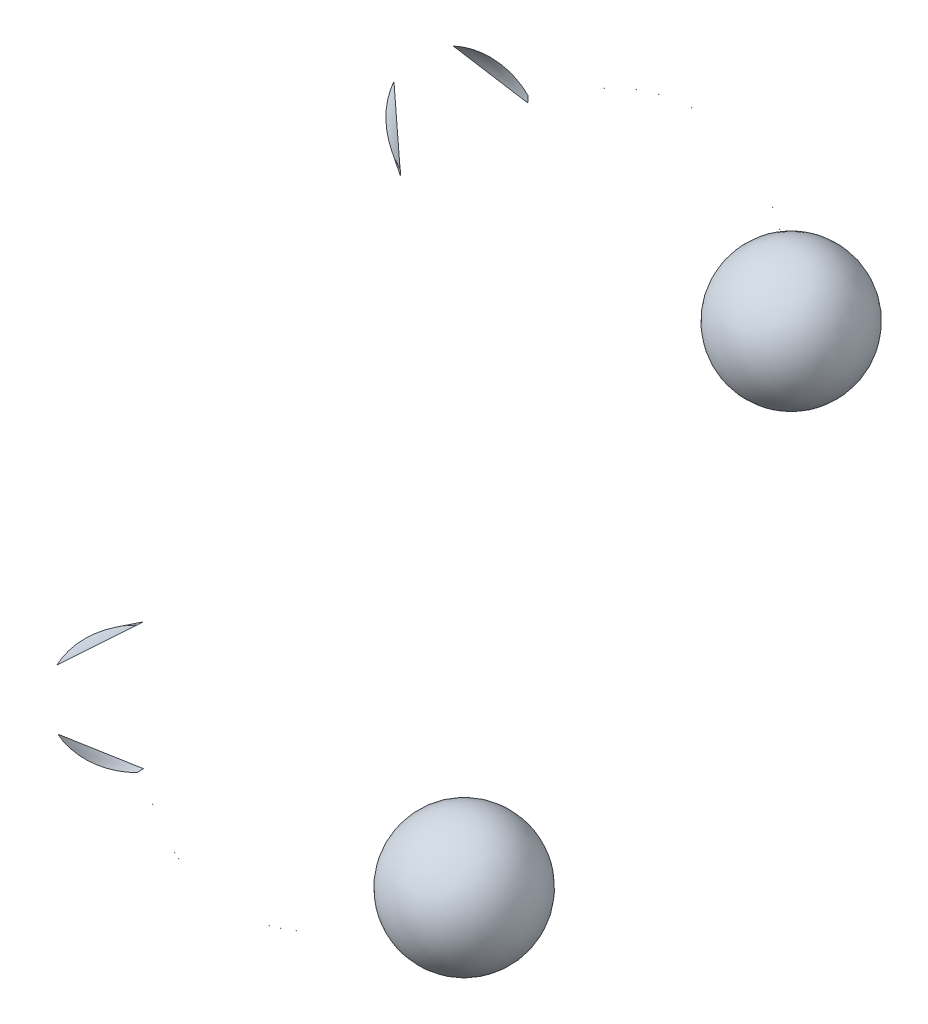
ISO-10303-21;
HEADER;
FILE_DESCRIPTION(('STEP AP214'),'2;1');
FILE_NAME('part.step','',(''),(''),'','','');
FILE_SCHEMA(('AUTOMOTIVE_DESIGN { 1 0 10303 214 1 1 1 1 }'));
ENDSEC;
DATA;
#1=APPLICATION_CONTEXT('core data for automotive mechanical design processes');
#2=APPLICATION_PROTOCOL_DEFINITION('international standard','automotive_design',2000,#1);
#3=PRODUCT_CONTEXT('',#1,'mechanical');
#4=PRODUCT('Part','Part','',(#3));
#5=PRODUCT_RELATED_PRODUCT_CATEGORY('part','',(#4));
#6=PRODUCT_DEFINITION_FORMATION('','',#4);
#7=PRODUCT_DEFINITION_CONTEXT('part definition',#1,'design');
#8=PRODUCT_DEFINITION('design','',#6,#7);
#9=PRODUCT_DEFINITION_SHAPE('','',#8);
#10=(LENGTH_UNIT() NAMED_UNIT(*) SI_UNIT(.MILLI.,.METRE.));
#11=(NAMED_UNIT(*) PLANE_ANGLE_UNIT() SI_UNIT($,.RADIAN.));
#12=(NAMED_UNIT(*) SI_UNIT($,.STERADIAN.) SOLID_ANGLE_UNIT());
#13=UNCERTAINTY_MEASURE_WITH_UNIT(LENGTH_MEASURE(1.E-05),#10,'distance_accuracy_value','');
#14=(GEOMETRIC_REPRESENTATION_CONTEXT(3) GLOBAL_UNCERTAINTY_ASSIGNED_CONTEXT((#13)) GLOBAL_UNIT_ASSIGNED_CONTEXT((#10,
#11,#12)) REPRESENTATION_CONTEXT('',''));
#15=CARTESIAN_POINT('',(0.,0.,0.));
#16=DIRECTION('',(0.,0.,1.));
#17=DIRECTION('',(1.,0.,0.));
#18=AXIS2_PLACEMENT_3D('',#15,#16,#17);
#19=CARTESIAN_POINT('',(4.5,0.,0.));
#20=DIRECTION('',(1.,0.,0.));
#21=DIRECTION('',(0.,-1.,0.));
#22=AXIS2_PLACEMENT_3D('',#19,#20,#21);
#23=TOROIDAL_SURFACE('',#22,21.325,0.0001);
#24=CARTESIAN_POINT('',(4.49996911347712,-4.14674458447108,-20.9180350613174));
#25=CARTESIAN_POINT('',(4.49996377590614,-4.1467444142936,-20.9180333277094));
#26=CARTESIAN_POINT('',(4.49995858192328,-4.14674419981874,-20.9180311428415));
#27=CARTESIAN_POINT('',(4.49994863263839,-4.1467436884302,-20.9180259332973));
#28=CARTESIAN_POINT('',(4.49994387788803,-4.14674339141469,-20.9180229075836));
#29=CARTESIAN_POINT('',(4.4999349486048,-4.14674272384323,-20.9180161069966));
#30=CARTESIAN_POINT('',(4.49993077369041,-4.14674235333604,-20.9180123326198));
#31=CARTESIAN_POINT('',(4.49992311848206,-4.14674154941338,-20.9180041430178));
#32=CARTESIAN_POINT('',(4.49991963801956,-4.14674111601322,-20.9179997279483));
#33=CARTESIAN_POINT('',(4.49991345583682,-4.14674019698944,-20.9179903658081));
#34=CARTESIAN_POINT('',(4.49991075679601,-4.14673971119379,-20.9179854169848));
#35=CARTESIAN_POINT('',(4.49990622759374,-4.14673870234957,-20.9179751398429));
#36=CARTESIAN_POINT('',(4.49990439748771,-4.14673817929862,-20.9179698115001));
#37=CARTESIAN_POINT('',(4.49990165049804,-4.14673710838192,-20.9179589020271));
#38=CARTESIAN_POINT('',(4.49990073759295,-4.14673656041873,-20.9179533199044));
#39=CARTESIAN_POINT('',(4.49989986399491,-4.14673545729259,-20.917942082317));
#40=CARTESIAN_POINT('',(4.49989990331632,-4.14673490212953,-20.9179364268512));
#41=CARTESIAN_POINT('',(4.49990093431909,-4.14673379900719,-20.917925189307));
#42=CARTESIAN_POINT('',(4.49990192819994,-4.14673325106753,-20.9179196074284));
#43=CARTESIAN_POINT('',(4.49990484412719,-4.14673217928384,-20.9179086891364));
#44=CARTESIAN_POINT('',(4.49990676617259,-4.1467316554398,-20.9179033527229));
#45=CARTESIAN_POINT('',(4.49991148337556,-4.1467306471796,-20.9178930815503));
#46=CARTESIAN_POINT('',(4.49991427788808,-4.14673016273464,-20.917888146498));
#47=CARTESIAN_POINT('',(4.49992066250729,-4.14672924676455,-20.9178788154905));
#48=CARTESIAN_POINT('',(4.49992425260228,-4.14672881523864,-20.9178744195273));
#49=CARTESIAN_POINT('',(4.49993211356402,-4.1467280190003,-20.9178663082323));
#50=CARTESIAN_POINT('',(4.49993638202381,-4.14672765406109,-20.9178625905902));
#51=CARTESIAN_POINT('',(4.49994548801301,-4.14672699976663,-20.917855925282));
#52=CARTESIAN_POINT('',(4.49995032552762,-4.14672671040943,-20.9178529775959));
#53=CARTESIAN_POINT('',(4.49996040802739,-4.14672621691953,-20.9178479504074));
#54=CARTESIAN_POINT('',(4.4999656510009,-4.14672601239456,-20.9178458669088));
#55=CARTESIAN_POINT('',(4.4999764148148,-4.14672569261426,-20.9178426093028));
#56=CARTESIAN_POINT('',(4.4999819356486,-4.14672557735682,-20.9178414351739));
#57=CARTESIAN_POINT('',(4.49999307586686,-4.14672543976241,-20.9178400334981));
#58=CARTESIAN_POINT('',(4.49999869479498,-4.14672541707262,-20.9178398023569));
#59=CARTESIAN_POINT('',(4.50000989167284,-4.14672546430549,-20.9178402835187));
#60=CARTESIAN_POINT('',(4.50001546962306,-4.14672553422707,-20.9178409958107));
#61=CARTESIAN_POINT('',(4.50002641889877,-4.14672576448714,-20.9178433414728));
#62=CARTESIAN_POINT('',(4.50003179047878,-4.14672592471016,-20.9178449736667));
#63=CARTESIAN_POINT('',(4.5000421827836,-4.14672633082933,-20.917849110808));
#64=CARTESIAN_POINT('',(4.50004720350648,-4.14672657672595,-20.9178516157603));
#65=CARTESIAN_POINT('',(4.50005676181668,-4.1467271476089,-20.9178574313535));
#66=CARTESIAN_POINT('',(4.50006129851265,-4.14672747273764,-20.9178607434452));
#67=CARTESIAN_POINT('',(4.50006975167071,-4.14672819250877,-20.9178680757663));
#68=CARTESIAN_POINT('',(4.50007366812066,-4.14672858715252,-20.9178720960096));
#69=CARTESIAN_POINT('',(4.50008078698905,-4.14672943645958,-20.9178807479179));
#70=CARTESIAN_POINT('',(4.50008398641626,-4.14672989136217,-20.9178853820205));
#71=CARTESIAN_POINT('',(4.50008956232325,-4.14673084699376,-20.9178951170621));
#72=CARTESIAN_POINT('',(4.50009193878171,-4.14673134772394,-20.9179002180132));
#73=CARTESIAN_POINT('',(4.50009581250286,-4.14673238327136,-20.9179107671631));
#74=CARTESIAN_POINT('',(4.50009730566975,-4.14673291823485,-20.9179162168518));
#75=CARTESIAN_POINT('',(4.50009935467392,-4.14673400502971,-20.917927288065));
#76=CARTESIAN_POINT('',(4.50009991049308,-4.1467345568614,-20.9179329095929));
#77=CARTESIAN_POINT('',(4.50010006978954,-4.14673566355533,-20.9179441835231));
#78=CARTESIAN_POINT('',(4.50009967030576,-4.14673621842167,-20.9179498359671));
#79=CARTESIAN_POINT('',(4.50009792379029,-4.14673731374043,-20.9179609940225));
#80=CARTESIAN_POINT('',(4.50009657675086,-4.14673785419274,-20.9179664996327));
#81=CARTESIAN_POINT('',(4.50009297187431,-4.14673890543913,-20.9179772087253));
#82=CARTESIAN_POINT('',(4.50009071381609,-4.14673941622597,-20.917982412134));
#83=CARTESIAN_POINT('',(4.50008534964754,-4.14674039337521,-20.9179923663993));
#84=CARTESIAN_POINT('',(4.50008224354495,-4.14674085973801,-20.9179971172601));
#85=CARTESIAN_POINT('',(4.50007527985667,-4.1467417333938,-20.9180060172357));
#86=CARTESIAN_POINT('',(4.50007142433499,-4.14674214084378,-20.91801016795));
#87=CARTESIAN_POINT('',(4.50006306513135,-4.14674288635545,-20.9180177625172));
#88=CARTESIAN_POINT('',(4.50005856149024,-4.1467432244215,-20.9180212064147));
#89=CARTESIAN_POINT('',(4.50004905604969,-4.14674381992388,-20.9180272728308));
#90=CARTESIAN_POINT('',(4.50004405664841,-4.14674407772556,-20.9180298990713));
#91=CARTESIAN_POINT('',(4.50003368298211,-4.14674450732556,-20.9180342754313));
#92=CARTESIAN_POINT('',(4.50002830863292,-4.14674467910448,-20.9180360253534));
#93=CARTESIAN_POINT('',(4.50001736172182,-4.14674493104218,-20.9180385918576));
#94=CARTESIAN_POINT('',(4.50001178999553,-4.14674501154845,-20.9180394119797));
#95=CARTESIAN_POINT('',(4.50000059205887,-4.14674507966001,-20.9180401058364));
#96=CARTESIAN_POINT('',(4.49999496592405,-4.14674506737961,-20.9180399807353));
#97=CARTESIAN_POINT('',(4.49998594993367,-4.14674497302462,-20.9180390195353));
#98=CARTESIAN_POINT('',(4.49998252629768,-4.14674491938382,-20.9180384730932));
#99=CARTESIAN_POINT('',(4.49997575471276,-4.14674477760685,-20.9180370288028));
#100=CARTESIAN_POINT('',(4.49997240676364,-4.14674468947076,-20.9180361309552));
#101=CARTESIAN_POINT('',(4.49996911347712,-4.14674458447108,-20.9180350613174));
#102=B_SPLINE_CURVE_WITH_KNOTS('',3,(#24,#25,#26,#27,#28,#29,#30,#31,#32,#33,#34,#35,#36,#37,
#38,#39,#40,#41,#42,#43,#44,#45,#46,#47,#48,#49,#50,#51,#52,#53,#54,#55,#56,#57,#58,#59,#60,#61,
#62,#63,#64,#65,#66,#67,#68,#69,#70,#71,#72,#73,#74,#75,#76,#77,#78,#79,#80,#81,#82,#83,#84,#85,
#86,#87,#88,#89,#90,#91,#92,#93,#94,#95,#96,#97,#98,#99,#100,#101),.UNSPECIFIED.,.T.,.F.,(4,2,2,
2,2,2,2,2,2,2,2,2,2,2,2,2,2,2,2,2,2,2,2,2,2,2,2,2,2,2,2,2,2,2,2,2,2,2,4),(0.,
1.6831166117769E-05,3.36831921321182E-05,5.05240764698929E-05,6.73608685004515E-05,
8.42547265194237E-05,0.000101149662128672,0.000118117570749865,0.000135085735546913,
0.000152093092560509,0.000169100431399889,0.000186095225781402,0.000203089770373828,
0.000220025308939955,0.0002369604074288,0.000253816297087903,0.000270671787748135,
0.000287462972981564,0.000304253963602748,0.000321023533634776,0.000337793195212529,
0.000354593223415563,0.000371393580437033,0.00038826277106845,0.000405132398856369,
0.000422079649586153,0.000439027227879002,0.000456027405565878,0.000473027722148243,
0.000490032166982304,0.000507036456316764,0.000523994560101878,0.000540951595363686,
0.000557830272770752,0.000574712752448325,0.000591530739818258,0.00060832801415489,
0.000618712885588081,0.000629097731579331),.UNSPECIFIED.);
#103=CARTESIAN_POINT('',(4.49996911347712,-4.14674458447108,-20.9180350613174));
#104=VERTEX_POINT('',#103);
#105=EDGE_CURVE('E9',#104,#104,#102,.T.);
#106=ORIENTED_EDGE('',*,*,#105,.F.);
#107=EDGE_LOOP('',(#106));
#108=FACE_BOUND('',#107,.T.);
#109=CARTESIAN_POINT('',(4.49996911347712,-20.9180350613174,-4.14674458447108));
#110=CARTESIAN_POINT('',(4.4999744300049,-20.918036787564,-4.14674475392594));
#111=CARTESIAN_POINT('',(4.49997989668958,-20.9180380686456,-4.14674487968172));
#112=CARTESIAN_POINT('',(4.49999097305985,-20.9180397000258,-4.14674503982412));
#113=CARTESIAN_POINT('',(4.49999658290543,-20.9180400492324,-4.14674507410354));
#114=CARTESIAN_POINT('',(4.50000777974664,-20.9180398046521,-4.14674505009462));
#115=CARTESIAN_POINT('',(4.50001336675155,-20.9180392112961,-4.14674499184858));
#116=CARTESIAN_POINT('',(4.50002435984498,-20.918037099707,-4.14674478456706));
#117=CARTESIAN_POINT('',(4.5000297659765,-20.9180355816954,-4.14674463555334));
#118=CARTESIAN_POINT('',(4.50004024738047,-20.9180316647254,-4.14674425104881));
#119=CARTESIAN_POINT('',(4.5000453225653,-20.9180292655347,-4.14674401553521));
#120=CARTESIAN_POINT('',(4.50005499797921,-20.9180236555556,-4.14674346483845));
#121=CARTESIAN_POINT('',(4.5000595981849,-20.9180204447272,-4.14674314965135));
#122=CARTESIAN_POINT('',(4.50006820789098,-20.9180132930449,-4.14674244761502));
#123=CARTESIAN_POINT('',(4.50007221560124,-20.9180093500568,-4.14674206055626));
#124=CARTESIAN_POINT('',(4.50007951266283,-20.9180008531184,-4.14674122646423));
#125=CARTESIAN_POINT('',(4.50008280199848,-20.9179962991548,-4.14674077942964));
#126=CARTESIAN_POINT('',(4.50008858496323,-20.9179866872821,-4.14673983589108));
#127=CARTESIAN_POINT('',(4.5000910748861,-20.9179816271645,-4.14673933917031));
#128=CARTESIAN_POINT('',(4.50009516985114,-20.9179711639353,-4.14673831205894));
#129=CARTESIAN_POINT('',(4.50009677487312,-20.9179657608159,-4.14673778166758));
#130=CARTESIAN_POINT('',(4.50009906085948,-20.9179547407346,-4.14673669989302));
#131=CARTESIAN_POINT('',(4.50009973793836,-20.9179491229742,-4.14673614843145));
#132=CARTESIAN_POINT('',(4.50010013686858,-20.9179378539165,-4.14673504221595));
#133=CARTESIAN_POINT('',(4.50009985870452,-20.9179322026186,-4.14673448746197));
#134=CARTESIAN_POINT('',(4.50009835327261,-20.9179210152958,-4.14673338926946));
#135=CARTESIAN_POINT('',(4.50009712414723,-20.9179154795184,-4.14673284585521));
#136=CARTESIAN_POINT('',(4.5000937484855,-20.9179046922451,-4.14673178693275));
#137=CARTESIAN_POINT('',(4.50009160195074,-20.9178994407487,-4.14673127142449));
#138=CARTESIAN_POINT('',(4.50008645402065,-20.9178893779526,-4.14673028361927));
#139=CARTESIAN_POINT('',(4.50008345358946,-20.9178845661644,-4.14672981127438));
#140=CARTESIAN_POINT('',(4.50007668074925,-20.917875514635,-4.14672892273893));
#141=CARTESIAN_POINT('',(4.50007290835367,-20.9178712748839,-4.14672850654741));
#142=CARTESIAN_POINT('',(4.50006471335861,-20.9178635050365,-4.14672774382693));
#143=CARTESIAN_POINT('',(4.5000602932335,-20.9178599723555,-4.14672739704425));
#144=CARTESIAN_POINT('',(4.50005091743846,-20.9178536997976,-4.14672678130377));
#145=CARTESIAN_POINT('',(4.50004596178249,-20.9178509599,-4.14672651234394));
#146=CARTESIAN_POINT('',(4.5000356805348,-20.9178463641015,-4.14672606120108));
#147=CARTESIAN_POINT('',(4.50003035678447,-20.9178445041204,-4.14672587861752));
#148=CARTESIAN_POINT('',(4.50001947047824,-20.9178417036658,-4.14672560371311));
#149=CARTESIAN_POINT('',(4.50001390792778,-20.9178407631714,-4.14672551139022));
#150=CARTESIAN_POINT('',(4.50000272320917,-20.9178398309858,-4.14672541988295));
#151=CARTESIAN_POINT('',(4.49999710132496,-20.9178398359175,-4.14672542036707));
#152=CARTESIAN_POINT('',(4.499985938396,-20.9178407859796,-4.14672551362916));
#153=CARTESIAN_POINT('',(4.49998039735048,-20.9178417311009,-4.14672560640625));
#154=CARTESIAN_POINT('',(4.49996955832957,-20.9178445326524,-4.14672588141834));
#155=CARTESIAN_POINT('',(4.49996426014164,-20.9178463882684,-4.14672606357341));
#156=CARTESIAN_POINT('',(4.49995405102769,-20.9178509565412,-4.14672651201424));
#157=CARTESIAN_POINT('',(4.49994914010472,-20.9178536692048,-4.14672677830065));
#158=CARTESIAN_POINT('',(4.49993983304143,-20.9178598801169,-4.14672738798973));
#159=CARTESIAN_POINT('',(4.4999354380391,-20.9178633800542,-4.14672773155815));
#160=CARTESIAN_POINT('',(4.49992729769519,-20.917871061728,-4.14672848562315));
#161=CARTESIAN_POINT('',(4.49992355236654,-20.9178752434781,-4.14672889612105));
#162=CARTESIAN_POINT('',(4.49991680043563,-20.9178841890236,-4.14672977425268));
#163=CARTESIAN_POINT('',(4.49991379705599,-20.917888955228,-4.14673024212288));
#164=CARTESIAN_POINT('',(4.49990863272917,-20.9178989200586,-4.14673122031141));
#165=CARTESIAN_POINT('',(4.499906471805,-20.9179041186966,-4.14673173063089));
#166=CARTESIAN_POINT('',(4.49990304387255,-20.9179148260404,-4.14673278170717));
#167=CARTESIAN_POINT('',(4.49990178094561,-20.9179203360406,-4.14673332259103));
#168=CARTESIAN_POINT('',(4.49990019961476,-20.9179314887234,-4.14673441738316));
#169=CARTESIAN_POINT('',(4.49989988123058,-20.9179371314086,-4.14673497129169));
#170=CARTESIAN_POINT('',(4.49990019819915,-20.9179484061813,-4.14673607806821));
#171=CARTESIAN_POINT('',(4.49990083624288,-20.9179540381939,-4.14673663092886));
#172=CARTESIAN_POINT('',(4.49990305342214,-20.9179651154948,-4.14673771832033));
#173=CARTESIAN_POINT('',(4.49990463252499,-20.9179705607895,-4.14673825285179));
#174=CARTESIAN_POINT('',(4.49990868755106,-20.9179811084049,-4.14673928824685));
#175=CARTESIAN_POINT('',(4.49991116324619,-20.9179862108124,-4.14673978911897));
#176=CARTESIAN_POINT('',(4.49991694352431,-20.9179959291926,-4.14674074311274));
#177=CARTESIAN_POINT('',(4.49992024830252,-20.9180005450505,-4.14674119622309));
#178=CARTESIAN_POINT('',(4.49992758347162,-20.9180091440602,-4.14674204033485));
#179=CARTESIAN_POINT('',(4.4999316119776,-20.9180131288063,-4.14674243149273));
#180=CARTESIAN_POINT('',(4.49994028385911,-20.9180203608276,-4.14674314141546));
#181=CARTESIAN_POINT('',(4.4999449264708,-20.9180236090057,-4.14674346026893));
#182=CARTESIAN_POINT('',(4.49995286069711,-20.9180282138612,-4.14674391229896));
#183=CARTESIAN_POINT('',(4.49995600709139,-20.9180298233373,-4.14674407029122));
#184=CARTESIAN_POINT('',(4.49996245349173,-20.9180327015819,-4.14674435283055));
#185=CARTESIAN_POINT('',(4.49996575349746,-20.9180339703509,-4.1467444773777));
#186=CARTESIAN_POINT('',(4.49996911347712,-20.9180350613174,-4.14674458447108));
#187=B_SPLINE_CURVE_WITH_KNOTS('',3,(#109,#110,#111,#112,#113,#114,#115,#116,#117,#118,#119,
#120,#121,#122,#123,#124,#125,#126,#127,#128,#129,#130,#131,#132,#133,#134,#135,#136,#137,#138,
#139,#140,#141,#142,#143,#144,#145,#146,#147,#148,#149,#150,#151,#152,#153,#154,#155,#156,#157,
#158,#159,#160,#161,#162,#163,#164,#165,#166,#167,#168,#169,#170,#171,#172,#173,#174,#175,#176,
#177,#178,#179,#180,#181,#182,#183,#184,#185,#186),.UNSPECIFIED.,.T.,.F.,(4,2,2,2,2,2,2,2,2,2,2,
2,2,2,2,2,2,2,2,2,2,2,2,2,2,2,2,2,2,2,2,2,2,2,2,2,2,2,4),(0.,1.67640939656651E-05,
3.35478219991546E-05,5.03238779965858E-05,6.7095915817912E-05,8.38723757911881E-05,
0.000100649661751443,0.000117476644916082,0.000134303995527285,0.000151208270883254,
0.000168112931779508,0.000185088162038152,0.000202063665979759,0.000219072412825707,
0.000236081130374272,0.000253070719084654,0.000270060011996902,0.000286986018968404,
0.000303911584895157,0.000320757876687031,0.000337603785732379,0.000354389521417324,
0.000371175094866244,0.00038794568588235,0.000404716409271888,0.000421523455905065,
0.000438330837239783,0.000455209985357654,0.000472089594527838,0.000489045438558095,
0.00050600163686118,0.000523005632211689,0.000540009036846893,0.000557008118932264,
0.000574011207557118,0.000590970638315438,0.000607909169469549,0.000618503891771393,
0.000629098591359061),.UNSPECIFIED.);
#188=CARTESIAN_POINT('',(4.49996911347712,-20.9180350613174,-4.14674458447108));
#189=VERTEX_POINT('',#188);
#190=EDGE_CURVE('E28',#189,#189,#187,.T.);
#191=ORIENTED_EDGE('',*,*,#190,.F.);
#192=EDGE_LOOP('',(#191));
#193=FACE_BOUND('',#192,.T.);
#194=ADVANCED_FACE('F13',(#108,#193),#23,.T.);
#195=CARTESIAN_POINT('',(4.49996911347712,4.14674458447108,-20.9180350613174));
#196=CARTESIAN_POINT('',(4.4999744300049,4.14674475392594,-20.918036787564));
#197=CARTESIAN_POINT('',(4.49997989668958,4.14674487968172,-20.9180380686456));
#198=CARTESIAN_POINT('',(4.49999097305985,4.14674503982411,-20.9180397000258));
#199=CARTESIAN_POINT('',(4.49999658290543,4.14674507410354,-20.9180400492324));
#200=CARTESIAN_POINT('',(4.50000777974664,4.14674505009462,-20.9180398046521));
#201=CARTESIAN_POINT('',(4.50001336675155,4.14674499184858,-20.9180392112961));
#202=CARTESIAN_POINT('',(4.50002435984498,4.14674478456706,-20.918037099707));
#203=CARTESIAN_POINT('',(4.5000297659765,4.14674463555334,-20.9180355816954));
#204=CARTESIAN_POINT('',(4.50004024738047,4.14674425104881,-20.9180316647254));
#205=CARTESIAN_POINT('',(4.5000453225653,4.14674401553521,-20.9180292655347));
#206=CARTESIAN_POINT('',(4.50005499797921,4.14674346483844,-20.9180236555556));
#207=CARTESIAN_POINT('',(4.5000595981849,4.14674314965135,-20.9180204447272));
#208=CARTESIAN_POINT('',(4.50006820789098,4.14674244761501,-20.9180132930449));
#209=CARTESIAN_POINT('',(4.50007221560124,4.14674206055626,-20.9180093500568));
#210=CARTESIAN_POINT('',(4.50007951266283,4.14674122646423,-20.9180008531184));
#211=CARTESIAN_POINT('',(4.50008280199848,4.14674077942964,-20.9179962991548));
#212=CARTESIAN_POINT('',(4.50008858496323,4.14673983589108,-20.9179866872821));
#213=CARTESIAN_POINT('',(4.5000910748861,4.14673933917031,-20.9179816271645));
#214=CARTESIAN_POINT('',(4.50009516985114,4.14673831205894,-20.9179711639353));
#215=CARTESIAN_POINT('',(4.50009677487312,4.14673778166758,-20.9179657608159));
#216=CARTESIAN_POINT('',(4.50009906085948,4.14673669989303,-20.9179547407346));
#217=CARTESIAN_POINT('',(4.50009973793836,4.14673614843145,-20.9179491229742));
#218=CARTESIAN_POINT('',(4.50010013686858,4.14673504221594,-20.9179378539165));
#219=CARTESIAN_POINT('',(4.50009985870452,4.14673448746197,-20.9179322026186));
#220=CARTESIAN_POINT('',(4.50009835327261,4.14673338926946,-20.9179210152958));
#221=CARTESIAN_POINT('',(4.50009712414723,4.14673284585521,-20.9179154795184));
#222=CARTESIAN_POINT('',(4.5000937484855,4.14673178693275,-20.9179046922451));
#223=CARTESIAN_POINT('',(4.50009160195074,4.14673127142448,-20.9178994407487));
#224=CARTESIAN_POINT('',(4.50008645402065,4.14673028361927,-20.9178893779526));
#225=CARTESIAN_POINT('',(4.50008345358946,4.14672981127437,-20.9178845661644));
#226=CARTESIAN_POINT('',(4.50007668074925,4.14672892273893,-20.917875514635));
#227=CARTESIAN_POINT('',(4.50007290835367,4.14672850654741,-20.9178712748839));
#228=CARTESIAN_POINT('',(4.50006471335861,4.14672774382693,-20.9178635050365));
#229=CARTESIAN_POINT('',(4.5000602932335,4.14672739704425,-20.9178599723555));
#230=CARTESIAN_POINT('',(4.50005091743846,4.14672678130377,-20.9178536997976));
#231=CARTESIAN_POINT('',(4.50004596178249,4.14672651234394,-20.9178509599));
#232=CARTESIAN_POINT('',(4.5000356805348,4.14672606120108,-20.9178463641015));
#233=CARTESIAN_POINT('',(4.50003035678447,4.14672587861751,-20.9178445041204));
#234=CARTESIAN_POINT('',(4.50001947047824,4.14672560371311,-20.9178417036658));
#235=CARTESIAN_POINT('',(4.50001390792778,4.14672551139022,-20.9178407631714));
#236=CARTESIAN_POINT('',(4.50000272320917,4.14672541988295,-20.9178398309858));
#237=CARTESIAN_POINT('',(4.49999710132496,4.14672542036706,-20.9178398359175));
#238=CARTESIAN_POINT('',(4.499985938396,4.14672551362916,-20.9178407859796));
#239=CARTESIAN_POINT('',(4.49998039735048,4.14672560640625,-20.9178417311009));
#240=CARTESIAN_POINT('',(4.49996955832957,4.14672588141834,-20.9178445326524));
#241=CARTESIAN_POINT('',(4.49996426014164,4.14672606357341,-20.9178463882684));
#242=CARTESIAN_POINT('',(4.49995405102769,4.14672651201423,-20.9178509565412));
#243=CARTESIAN_POINT('',(4.49994914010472,4.14672677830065,-20.9178536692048));
#244=CARTESIAN_POINT('',(4.49993983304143,4.14672738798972,-20.9178598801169));
#245=CARTESIAN_POINT('',(4.4999354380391,4.14672773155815,-20.9178633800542));
#246=CARTESIAN_POINT('',(4.49992729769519,4.14672848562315,-20.917871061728));
#247=CARTESIAN_POINT('',(4.49992355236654,4.14672889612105,-20.9178752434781));
#248=CARTESIAN_POINT('',(4.49991680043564,4.14672977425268,-20.9178841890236));
#249=CARTESIAN_POINT('',(4.49991379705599,4.14673024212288,-20.917888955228));
#250=CARTESIAN_POINT('',(4.49990863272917,4.14673122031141,-20.9178989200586));
#251=CARTESIAN_POINT('',(4.499906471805,4.14673173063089,-20.9179041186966));
#252=CARTESIAN_POINT('',(4.49990304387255,4.14673278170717,-20.9179148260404));
#253=CARTESIAN_POINT('',(4.49990178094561,4.14673332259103,-20.9179203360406));
#254=CARTESIAN_POINT('',(4.49990019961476,4.14673441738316,-20.9179314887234));
#255=CARTESIAN_POINT('',(4.49989988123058,4.14673497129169,-20.9179371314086));
#256=CARTESIAN_POINT('',(4.49990019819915,4.14673607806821,-20.9179484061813));
#257=CARTESIAN_POINT('',(4.49990083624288,4.14673663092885,-20.9179540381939));
#258=CARTESIAN_POINT('',(4.49990305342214,4.14673771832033,-20.9179651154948));
#259=CARTESIAN_POINT('',(4.49990463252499,4.14673825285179,-20.9179705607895));
#260=CARTESIAN_POINT('',(4.49990868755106,4.14673928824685,-20.9179811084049));
#261=CARTESIAN_POINT('',(4.49991116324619,4.14673978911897,-20.9179862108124));
#262=CARTESIAN_POINT('',(4.49991694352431,4.14674074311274,-20.9179959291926));
#263=CARTESIAN_POINT('',(4.49992024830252,4.14674119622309,-20.9180005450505));
#264=CARTESIAN_POINT('',(4.49992758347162,4.14674204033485,-20.9180091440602));
#265=CARTESIAN_POINT('',(4.4999316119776,4.14674243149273,-20.9180131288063));
#266=CARTESIAN_POINT('',(4.49994028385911,4.14674314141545,-20.9180203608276));
#267=CARTESIAN_POINT('',(4.4999449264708,4.14674346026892,-20.9180236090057));
#268=CARTESIAN_POINT('',(4.49995286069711,4.14674391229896,-20.9180282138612));
#269=CARTESIAN_POINT('',(4.49995600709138,4.14674407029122,-20.9180298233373));
#270=CARTESIAN_POINT('',(4.49996245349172,4.14674435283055,-20.9180327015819));
#271=CARTESIAN_POINT('',(4.49996575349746,4.1467444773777,-20.9180339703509));
#272=CARTESIAN_POINT('',(4.49996911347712,4.14674458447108,-20.9180350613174));
#273=B_SPLINE_CURVE_WITH_KNOTS('',3,(#195,#196,#197,#198,#199,#200,#201,#202,#203,#204,#205,
#206,#207,#208,#209,#210,#211,#212,#213,#214,#215,#216,#217,#218,#219,#220,#221,#222,#223,#224,
#225,#226,#227,#228,#229,#230,#231,#232,#233,#234,#235,#236,#237,#238,#239,#240,#241,#242,#243,
#244,#245,#246,#247,#248,#249,#250,#251,#252,#253,#254,#255,#256,#257,#258,#259,#260,#261,#262,
#263,#264,#265,#266,#267,#268,#269,#270,#271,#272),.UNSPECIFIED.,.T.,.F.,(4,2,2,2,2,2,2,2,2,2,2,
2,2,2,2,2,2,2,2,2,2,2,2,2,2,2,2,2,2,2,2,2,2,2,2,2,2,2,4),(0.,1.67640939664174E-05,
3.35478219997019E-05,5.0323877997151E-05,6.70959158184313E-05,8.387237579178E-05,
0.000100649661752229,0.00011747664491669,0.000134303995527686,0.000151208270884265,
0.00016811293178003,0.000185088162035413,0.0002020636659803,0.000219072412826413,
0.000236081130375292,0.000253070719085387,0.000270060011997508,0.000286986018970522,
0.000303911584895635,0.000320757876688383,0.000337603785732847,0.000354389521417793,
0.000371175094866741,0.000387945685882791,0.000404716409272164,0.000421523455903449,
0.000438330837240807,0.000455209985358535,0.000472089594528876,0.00048904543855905,
0.000506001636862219,0.00052300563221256,0.000540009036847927,0.0005570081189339,
0.000574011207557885,0.000590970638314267,0.000607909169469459,0.000618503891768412,
0.000629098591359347),.UNSPECIFIED.);
#274=CARTESIAN_POINT('',(4.49996911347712,4.14674458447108,-20.9180350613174));
#275=VERTEX_POINT('',#274);
#276=EDGE_CURVE('E24',#275,#275,#273,.T.);
#277=ORIENTED_EDGE('',*,*,#276,.F.);
#278=EDGE_LOOP('',(#277));
#279=FACE_BOUND('',#278,.T.);
#280=CARTESIAN_POINT('',(4.49995518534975,20.917850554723,-4.14672647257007));
#281=CARTESIAN_POINT('',(4.49996018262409,20.9178480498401,-4.14672622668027));
#282=CARTESIAN_POINT('',(4.49996539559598,20.9178459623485,-4.14672602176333));
#283=CARTESIAN_POINT('',(4.49997610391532,20.917842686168,-4.14672570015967));
#284=CARTESIAN_POINT('',(4.49998159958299,20.9178414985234,-4.14672558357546));
#285=CARTESIAN_POINT('',(4.499992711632,20.9178400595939,-4.14672544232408));
#286=CARTESIAN_POINT('',(4.49999832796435,20.917839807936,-4.14672541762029));
#287=CARTESIAN_POINT('',(4.50000952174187,20.91784024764,-4.14672546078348));
#288=CARTESIAN_POINT('',(4.5000150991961,20.9178409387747,-4.14672552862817));
#289=CARTESIAN_POINT('',(4.50002605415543,20.9178432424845,-4.14672575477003));
#290=CARTESIAN_POINT('',(4.50003143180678,20.9178448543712,-4.14672591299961));
#291=CARTESIAN_POINT('',(4.50004183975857,20.9178489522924,-4.14672631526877));
#292=CARTESIAN_POINT('',(4.50004687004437,20.9178514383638,-4.14672655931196));
#293=CARTESIAN_POINT('',(4.5000564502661,20.9178572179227,-4.14672712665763));
#294=CARTESIAN_POINT('',(4.50006099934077,20.9178605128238,-4.14672745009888));
#295=CARTESIAN_POINT('',(4.50006947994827,20.9178678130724,-4.14672816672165));
#296=CARTESIAN_POINT('',(4.50007341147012,20.9178718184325,-4.1467285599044));
#297=CARTESIAN_POINT('',(4.50008056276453,20.9178804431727,-4.14672940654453));
#298=CARTESIAN_POINT('',(4.50008377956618,20.9178850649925,-4.1467298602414));
#299=CARTESIAN_POINT('',(4.50008939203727,20.9178947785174,-4.14673081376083));
#300=CARTESIAN_POINT('',(4.50009178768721,20.9178998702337,-4.14673131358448));
#301=CARTESIAN_POINT('',(4.50009570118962,20.9179104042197,-4.14673234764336));
#302=CARTESIAN_POINT('',(4.50009721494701,20.9179158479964,-4.14673288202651));
#303=CARTESIAN_POINT('',(4.50009930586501,20.9179269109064,-4.1467339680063));
#304=CARTESIAN_POINT('',(4.50009988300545,20.9179325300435,-4.14673451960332));
#305=CARTESIAN_POINT('',(4.50010008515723,20.917943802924,-4.14673562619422));
#306=CARTESIAN_POINT('',(4.5000997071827,20.9179494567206,-4.14673618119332));
#307=CARTESIAN_POINT('',(4.50009800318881,20.9179606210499,-4.14673727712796));
#308=CARTESIAN_POINT('',(4.50009667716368,20.9179661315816,-4.1467378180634));
#309=CARTESIAN_POINT('',(4.5000931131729,20.9179768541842,-4.146738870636));
#310=CARTESIAN_POINT('',(4.50009087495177,20.917982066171,-4.1467393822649));
#311=CARTESIAN_POINT('',(4.50008554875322,20.9179920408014,-4.14674036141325));
#312=CARTESIAN_POINT('',(4.50008246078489,20.9179968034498,-4.14674082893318));
#313=CARTESIAN_POINT('',(4.50007553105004,20.9180057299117,-4.14674170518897));
#314=CARTESIAN_POINT('',(4.50007169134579,20.9180098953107,-4.14674211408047));
#315=CARTESIAN_POINT('',(4.50006336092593,20.9180175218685,-4.14674286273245));
#316=CARTESIAN_POINT('',(4.5000588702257,20.9180209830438,-4.14674320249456));
#317=CARTESIAN_POINT('',(4.50004938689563,20.9180270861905,-4.14674380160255));
#318=CARTESIAN_POINT('',(4.50004439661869,20.918029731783,-4.1467440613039));
#319=CARTESIAN_POINT('',(4.50003403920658,20.9180341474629,-4.14674449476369));
#320=CARTESIAN_POINT('',(4.50002867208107,20.9180359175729,-4.14674466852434));
#321=CARTESIAN_POINT('',(4.50001773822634,20.918038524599,-4.14674492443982));
#322=CARTESIAN_POINT('',(4.50001217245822,20.9180393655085,-4.14674500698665));
#323=CARTESIAN_POINT('',(4.50000097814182,20.9180401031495,-4.14674507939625));
#324=CARTESIAN_POINT('',(4.49999534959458,20.9180399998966,-4.14674506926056));
#325=CARTESIAN_POINT('',(4.49998420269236,20.9180388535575,-4.14674495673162));
#326=CARTESIAN_POINT('',(4.49997868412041,20.9180378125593,-4.14674485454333));
#327=CARTESIAN_POINT('',(4.49996790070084,20.9180348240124,-4.14674456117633));
#328=CARTESIAN_POINT('',(4.49996263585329,20.9180328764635,-4.1467443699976));
#329=CARTESIAN_POINT('',(4.49995250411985,20.9180281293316,-4.14674390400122));
#330=CARTESIAN_POINT('',(4.49994763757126,20.9180253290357,-4.14674362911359));
#331=CARTESIAN_POINT('',(4.49993844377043,20.9180189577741,-4.14674300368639));
#332=CARTESIAN_POINT('',(4.49993411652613,20.9180153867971,-4.14674265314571));
#333=CARTESIAN_POINT('',(4.49992610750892,20.918007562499,-4.14674188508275));
#334=CARTESIAN_POINT('',(4.49992242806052,20.9180033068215,-4.14674146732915));
#335=CARTESIAN_POINT('',(4.49991583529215,20.9179942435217,-4.14674057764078));
#336=CARTESIAN_POINT('',(4.49991292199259,20.9179894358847,-4.14674010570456));
#337=CARTESIAN_POINT('',(4.49990792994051,20.9179793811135,-4.1467391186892));
#338=CARTESIAN_POINT('',(4.49990585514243,20.9179741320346,-4.14673860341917));
#339=CARTESIAN_POINT('',(4.49990261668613,20.9179633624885,-4.14673754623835));
#340=CARTESIAN_POINT('',(4.49990145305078,20.9179578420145,-4.1467370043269));
#341=CARTESIAN_POINT('',(4.49990006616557,20.9179466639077,-4.14673590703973));
#342=CARTESIAN_POINT('',(4.49989984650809,20.9179410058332,-4.14673535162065));
#343=CARTESIAN_POINT('',(4.49990036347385,20.9179297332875,-4.14673424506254));
#344=CARTESIAN_POINT('',(4.49990110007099,20.917924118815,-4.14673369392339));
#345=CARTESIAN_POINT('',(4.49990351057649,20.9179130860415,-4.14673261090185));
#346=CARTESIAN_POINT('',(4.49990518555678,20.9179076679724,-4.14673207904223));
#347=CARTESIAN_POINT('',(4.49990942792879,20.9178971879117,-4.14673105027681));
#348=CARTESIAN_POINT('',(4.49991199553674,20.9178921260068,-4.14673055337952));
#349=CARTESIAN_POINT('',(4.49991794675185,20.9178825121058,-4.14672960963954));
#350=CARTESIAN_POINT('',(4.49992132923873,20.9178779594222,-4.14672916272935));
#351=CARTESIAN_POINT('',(4.49992881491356,20.9178694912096,-4.14672833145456));
#352=CARTESIAN_POINT('',(4.49993291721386,20.9178655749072,-4.14672794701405));
#353=CARTESIAN_POINT('',(4.49994008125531,20.9178598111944,-4.146727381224));
#354=CARTESIAN_POINT('',(4.4999429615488,20.9178577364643,-4.14672717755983));
#355=CARTESIAN_POINT('',(4.49994892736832,20.9178539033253,-4.1467268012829));
#356=CARTESIAN_POINT('',(4.49995201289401,20.917852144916,-4.14672662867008));
#357=CARTESIAN_POINT('',(4.49995518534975,20.917850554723,-4.14672647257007));
#358=B_SPLINE_CURVE_WITH_KNOTS('',3,(#280,#281,#282,#283,#284,#285,#286,#287,#288,#289,#290,
#291,#292,#293,#294,#295,#296,#297,#298,#299,#300,#301,#302,#303,#304,#305,#306,#307,#308,#309,
#310,#311,#312,#313,#314,#315,#316,#317,#318,#319,#320,#321,#322,#323,#324,#325,#326,#327,#328,
#329,#330,#331,#332,#333,#334,#335,#336,#337,#338,#339,#340,#341,#342,#343,#344,#345,#346,#347,
#348,#349,#350,#351,#352,#353,#354,#355,#356,#357),.UNSPECIFIED.,.T.,.F.,(4,2,2,2,2,2,2,2,2,2,2,
2,2,2,2,2,2,2,2,2,2,2,2,2,2,2,2,2,2,2,2,2,2,2,2,2,2,2,4),(0.,1.67730455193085E-05,
3.35655269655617E-05,5.03513142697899E-05,6.71330570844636E-05,8.39022660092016E-05,
0.000100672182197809,0.000117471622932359,0.000134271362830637,0.000151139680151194,
0.000168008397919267,0.000184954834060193,0.000201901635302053,0.000218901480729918,
0.000235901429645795,0.00025290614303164,0.00026991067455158,0.000286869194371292,
0.000303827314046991,0.000320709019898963,0.000337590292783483,0.000354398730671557,
0.000371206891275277,0.000387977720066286,0.000404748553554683,0.000421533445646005,
0.000438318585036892,0.000455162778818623,0.000472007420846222,0.000488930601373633,
0.000505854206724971,0.00052284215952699,0.000539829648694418,0.000556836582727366,
0.000573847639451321,0.000590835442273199,0.000607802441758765,0.000618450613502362,
0.000629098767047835),.UNSPECIFIED.);
#359=CARTESIAN_POINT('',(4.49995518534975,20.917850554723,-4.14672647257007));
#360=VERTEX_POINT('',#359);
#361=EDGE_CURVE('E66',#360,#360,#358,.T.);
#362=ORIENTED_EDGE('',*,*,#361,.F.);
#363=EDGE_LOOP('',(#362));
#364=FACE_BOUND('',#363,.T.);
#365=ADVANCED_FACE('F89',(#279,#364),#23,.T.);
#366=CARTESIAN_POINT('',(4.49996911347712,-20.9180350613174,4.14674458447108));
#367=CARTESIAN_POINT('',(4.49996377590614,-20.9180333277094,4.1467444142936));
#368=CARTESIAN_POINT('',(4.49995858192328,-20.9180311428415,4.14674419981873));
#369=CARTESIAN_POINT('',(4.49994863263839,-20.9180259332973,4.1467436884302));
#370=CARTESIAN_POINT('',(4.49994387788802,-20.9180229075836,4.14674339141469));
#371=CARTESIAN_POINT('',(4.4999349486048,-20.9180161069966,4.14674272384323));
#372=CARTESIAN_POINT('',(4.49993077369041,-20.9180123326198,4.14674235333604));
#373=CARTESIAN_POINT('',(4.49992311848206,-20.9180041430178,4.14674154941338));
#374=CARTESIAN_POINT('',(4.49991963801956,-20.9179997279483,4.14674111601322));
#375=CARTESIAN_POINT('',(4.49991345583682,-20.9179903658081,4.14674019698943));
#376=CARTESIAN_POINT('',(4.49991075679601,-20.9179854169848,4.14673971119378));
#377=CARTESIAN_POINT('',(4.49990622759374,-20.9179751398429,4.14673870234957));
#378=CARTESIAN_POINT('',(4.49990439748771,-20.9179698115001,4.14673817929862));
#379=CARTESIAN_POINT('',(4.49990165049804,-20.9179589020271,4.14673710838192));
#380=CARTESIAN_POINT('',(4.49990073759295,-20.9179533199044,4.14673656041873));
#381=CARTESIAN_POINT('',(4.4998998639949,-20.917942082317,4.14673545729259));
#382=CARTESIAN_POINT('',(4.49989990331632,-20.9179364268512,4.14673490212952));
#383=CARTESIAN_POINT('',(4.49990093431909,-20.917925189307,4.14673379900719));
#384=CARTESIAN_POINT('',(4.49990192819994,-20.9179196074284,4.14673325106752));
#385=CARTESIAN_POINT('',(4.49990484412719,-20.9179086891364,4.14673217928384));
#386=CARTESIAN_POINT('',(4.49990676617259,-20.9179033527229,4.1467316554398));
#387=CARTESIAN_POINT('',(4.49991148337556,-20.9178930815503,4.1467306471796));
#388=CARTESIAN_POINT('',(4.49991427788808,-20.917888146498,4.14673016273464));
#389=CARTESIAN_POINT('',(4.49992066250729,-20.9178788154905,4.14672924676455));
#390=CARTESIAN_POINT('',(4.49992425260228,-20.9178744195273,4.14672881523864));
#391=CARTESIAN_POINT('',(4.49993211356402,-20.9178663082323,4.1467280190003));
#392=CARTESIAN_POINT('',(4.49993638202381,-20.9178625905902,4.14672765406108));
#393=CARTESIAN_POINT('',(4.49994548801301,-20.917855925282,4.14672699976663));
#394=CARTESIAN_POINT('',(4.49995032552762,-20.9178529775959,4.14672671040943));
#395=CARTESIAN_POINT('',(4.49996040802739,-20.9178479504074,4.14672621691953));
#396=CARTESIAN_POINT('',(4.4999656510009,-20.9178458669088,4.14672601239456));
#397=CARTESIAN_POINT('',(4.4999764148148,-20.9178426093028,4.14672569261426));
#398=CARTESIAN_POINT('',(4.4999819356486,-20.9178414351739,4.14672557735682));
#399=CARTESIAN_POINT('',(4.49999307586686,-20.9178400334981,4.14672543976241));
#400=CARTESIAN_POINT('',(4.49999869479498,-20.9178398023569,4.14672541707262));
#401=CARTESIAN_POINT('',(4.50000989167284,-20.9178402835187,4.14672546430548));
#402=CARTESIAN_POINT('',(4.50001546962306,-20.9178409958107,4.14672553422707));
#403=CARTESIAN_POINT('',(4.50002641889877,-20.9178433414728,4.14672576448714));
#404=CARTESIAN_POINT('',(4.50003179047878,-20.9178449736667,4.14672592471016));
#405=CARTESIAN_POINT('',(4.5000421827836,-20.917849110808,4.14672633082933));
#406=CARTESIAN_POINT('',(4.50004720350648,-20.9178516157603,4.14672657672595));
#407=CARTESIAN_POINT('',(4.50005676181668,-20.9178574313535,4.14672714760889));
#408=CARTESIAN_POINT('',(4.50006129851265,-20.9178607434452,4.14672747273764));
#409=CARTESIAN_POINT('',(4.50006975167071,-20.9178680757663,4.14672819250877));
#410=CARTESIAN_POINT('',(4.50007366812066,-20.9178720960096,4.14672858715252));
#411=CARTESIAN_POINT('',(4.50008078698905,-20.9178807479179,4.14672943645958));
#412=CARTESIAN_POINT('',(4.50008398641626,-20.9178853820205,4.14672989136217));
#413=CARTESIAN_POINT('',(4.50008956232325,-20.9178951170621,4.14673084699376));
#414=CARTESIAN_POINT('',(4.50009193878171,-20.9179002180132,4.14673134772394));
#415=CARTESIAN_POINT('',(4.50009581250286,-20.9179107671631,4.14673238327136));
#416=CARTESIAN_POINT('',(4.50009730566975,-20.9179162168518,4.14673291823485));
#417=CARTESIAN_POINT('',(4.50009935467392,-20.917927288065,4.14673400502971));
#418=CARTESIAN_POINT('',(4.50009991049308,-20.9179329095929,4.1467345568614));
#419=CARTESIAN_POINT('',(4.50010006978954,-20.9179441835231,4.14673566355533));
#420=CARTESIAN_POINT('',(4.50009967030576,-20.9179498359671,4.14673621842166));
#421=CARTESIAN_POINT('',(4.50009792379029,-20.9179609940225,4.14673731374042));
#422=CARTESIAN_POINT('',(4.50009657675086,-20.9179664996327,4.14673785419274));
#423=CARTESIAN_POINT('',(4.50009297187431,-20.9179772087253,4.14673890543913));
#424=CARTESIAN_POINT('',(4.50009071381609,-20.917982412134,4.14673941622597));
#425=CARTESIAN_POINT('',(4.50008534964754,-20.9179923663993,4.14674039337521));
#426=CARTESIAN_POINT('',(4.50008224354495,-20.9179971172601,4.14674085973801));
#427=CARTESIAN_POINT('',(4.50007527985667,-20.9180060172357,4.1467417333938));
#428=CARTESIAN_POINT('',(4.50007142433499,-20.91801016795,4.14674214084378));
#429=CARTESIAN_POINT('',(4.50006306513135,-20.9180177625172,4.14674288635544));
#430=CARTESIAN_POINT('',(4.50005856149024,-20.9180212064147,4.1467432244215));
#431=CARTESIAN_POINT('',(4.5000490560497,-20.9180272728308,4.14674381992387));
#432=CARTESIAN_POINT('',(4.50004405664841,-20.9180298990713,4.14674407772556));
#433=CARTESIAN_POINT('',(4.50003368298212,-20.9180342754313,4.14674450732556));
#434=CARTESIAN_POINT('',(4.50002830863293,-20.9180360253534,4.14674467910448));
#435=CARTESIAN_POINT('',(4.50001736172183,-20.9180385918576,4.14674493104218));
#436=CARTESIAN_POINT('',(4.50001178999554,-20.9180394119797,4.14674501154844));
#437=CARTESIAN_POINT('',(4.50000059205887,-20.9180401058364,4.14674507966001));
#438=CARTESIAN_POINT('',(4.49999496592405,-20.9180399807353,4.14674506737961));
#439=CARTESIAN_POINT('',(4.49998594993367,-20.9180390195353,4.14674497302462));
#440=CARTESIAN_POINT('',(4.49998252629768,-20.9180384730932,4.14674491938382));
#441=CARTESIAN_POINT('',(4.49997575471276,-20.9180370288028,4.14674477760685));
#442=CARTESIAN_POINT('',(4.49997240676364,-20.9180361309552,4.14674468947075));
#443=CARTESIAN_POINT('',(4.49996911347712,-20.9180350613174,4.14674458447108));
#444=B_SPLINE_CURVE_WITH_KNOTS('',3,(#366,#367,#368,#369,#370,#371,#372,#373,#374,#375,#376,
#377,#378,#379,#380,#381,#382,#383,#384,#385,#386,#387,#388,#389,#390,#391,#392,#393,#394,#395,
#396,#397,#398,#399,#400,#401,#402,#403,#404,#405,#406,#407,#408,#409,#410,#411,#412,#413,#414,
#415,#416,#417,#418,#419,#420,#421,#422,#423,#424,#425,#426,#427,#428,#429,#430,#431,#432,#433,
#434,#435,#436,#437,#438,#439,#440,#441,#442,#443),.UNSPECIFIED.,.T.,.F.,(4,2,2,2,2,2,2,2,2,2,2,
2,2,2,2,2,2,2,2,2,2,2,2,2,2,2,2,2,2,2,2,2,2,2,2,2,2,2,4),(0.,1.6831166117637E-05,
3.3683192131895E-05,5.05240764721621E-05,6.73608685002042E-05,8.42547265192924E-05,
0.0001011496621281,0.000118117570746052,0.000135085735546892,0.000152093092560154,
0.000169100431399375,0.000186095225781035,0.00020308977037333,0.000220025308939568,
0.000236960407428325,0.000253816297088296,0.000270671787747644,0.000287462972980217,
0.000304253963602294,0.000321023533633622,0.000337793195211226,0.000354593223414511,
0.000371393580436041,0.000388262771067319,0.000405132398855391,0.000422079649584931,
0.000439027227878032,0.00045602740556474,0.000473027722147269,0.000490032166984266,
0.000507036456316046,0.000523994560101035,0.000540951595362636,0.000557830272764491,
0.000574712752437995,0.000591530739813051,0.000608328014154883,0.0006187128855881,
0.000629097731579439),.UNSPECIFIED.);
#445=CARTESIAN_POINT('',(4.49996911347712,-20.9180350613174,4.14674458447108));
#446=VERTEX_POINT('',#445);
#447=EDGE_CURVE('E32',#446,#446,#444,.T.);
#448=ORIENTED_EDGE('',*,*,#447,.F.);
#449=EDGE_LOOP('',(#448));
#450=FACE_BOUND('',#449,.T.);
#451=CARTESIAN_POINT('',(4.49995518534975,-4.14672647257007,20.917850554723));
#452=CARTESIAN_POINT('',(4.49995016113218,-4.14672671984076,20.917853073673));
#453=CARTESIAN_POINT('',(4.49994534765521,-4.14672700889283,20.9178560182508));
#454=CARTESIAN_POINT('',(4.49993628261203,-4.14672766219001,20.9178626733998));
#455=CARTESIAN_POINT('',(4.49993203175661,-4.14672802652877,20.917866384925));
#456=CARTESIAN_POINT('',(4.49992421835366,-4.14672881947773,20.9178744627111));
#457=CARTESIAN_POINT('',(4.49992065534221,-4.14672924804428,20.9178788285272));
#458=CARTESIAN_POINT('',(4.49991431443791,-4.14673015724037,20.9178880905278));
#459=CARTESIAN_POINT('',(4.4999115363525,-4.14673063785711,20.917892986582));
#460=CARTESIAN_POINT('',(4.499906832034,-4.14673163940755,20.9179031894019));
#461=CARTESIAN_POINT('',(4.49990490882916,-4.146732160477,20.9179084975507));
#462=CARTESIAN_POINT('',(4.49990198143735,-4.14673322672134,20.9179193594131));
#463=CARTESIAN_POINT('',(4.49990097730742,-4.14673377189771,20.9179249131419));
#464=CARTESIAN_POINT('',(4.49989991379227,-4.14673487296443,20.9179361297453));
#465=CARTESIAN_POINT('',(4.49989985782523,-4.14673542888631,20.9179417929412));
#466=CARTESIAN_POINT('',(4.499900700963,-4.1467365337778,20.9179530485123));
#467=CARTESIAN_POINT('',(4.49990160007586,-4.14673708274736,20.9179586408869));
#468=CARTESIAN_POINT('',(4.49990432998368,-4.14673815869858,20.9179696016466));
#469=CARTESIAN_POINT('',(4.49990616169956,-4.14673868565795,20.9179749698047));
#470=CARTESIAN_POINT('',(4.49991070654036,-4.14673970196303,20.9179853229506));
#471=CARTESIAN_POINT('',(4.49991341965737,-4.14674019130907,20.9179903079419));
#472=CARTESIAN_POINT('',(4.49991964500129,-4.14674111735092,20.9179997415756));
#473=CARTESIAN_POINT('',(4.49992315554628,-4.14674155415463,20.9180041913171));
#474=CARTESIAN_POINT('',(4.49993088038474,-4.14674236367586,20.9180124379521));
#475=CARTESIAN_POINT('',(4.49993509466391,-4.14674273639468,20.9180162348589));
#476=CARTESIAN_POINT('',(4.49994408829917,-4.14674340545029,20.9180230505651));
#477=CARTESIAN_POINT('',(4.49994886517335,-4.14674370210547,20.9180260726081));
#478=CARTESIAN_POINT('',(4.49995886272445,-4.14674421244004,20.9180312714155));
#479=CARTESIAN_POINT('',(4.49996408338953,-4.14674442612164,20.9180334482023));
#480=CARTESIAN_POINT('',(4.49997479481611,-4.14674476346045,20.9180368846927));
#481=CARTESIAN_POINT('',(4.49998028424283,-4.14674488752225,20.9180381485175));
#482=CARTESIAN_POINT('',(4.49999139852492,-4.14674504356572,20.9180397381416));
#483=CARTESIAN_POINT('',(4.49999702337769,-4.14674507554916,20.918040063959));
#484=CARTESIAN_POINT('',(4.50000823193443,-4.14674504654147,20.9180397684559));
#485=CARTESIAN_POINT('',(4.50001381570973,-4.14674498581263,20.9180391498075));
#486=CARTESIAN_POINT('',(4.50002479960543,-4.14674477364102,20.9180369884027));
#487=CARTESIAN_POINT('',(4.50003019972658,-4.14674462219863,20.9180354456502));
#488=CARTESIAN_POINT('',(4.50004066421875,-4.14674423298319,20.9180314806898));
#489=CARTESIAN_POINT('',(4.50004572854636,-4.14674399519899,20.9180290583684));
#490=CARTESIAN_POINT('',(4.50005537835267,-4.14674344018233,20.9180234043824));
#491=CARTESIAN_POINT('',(4.50005996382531,-4.14674312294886,20.9180201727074));
#492=CARTESIAN_POINT('',(4.50006854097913,-4.14674241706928,20.9180129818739));
#493=CARTESIAN_POINT('',(4.50007253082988,-4.14674202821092,20.9180090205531));
#494=CARTESIAN_POINT('',(4.50007978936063,-4.14674119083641,20.9180004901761));
#495=CARTESIAN_POINT('',(4.5000830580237,-4.14674074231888,20.9179959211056));
#496=CARTESIAN_POINT('',(4.50008879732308,-4.14673979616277,20.9179862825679));
#497=CARTESIAN_POINT('',(4.50009126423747,-4.14673929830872,20.9179812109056));
#498=CARTESIAN_POINT('',(4.50009531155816,-4.14673826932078,20.9179707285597));
#499=CARTESIAN_POINT('',(4.50009689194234,-4.14673773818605,20.9179653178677));
#500=CARTESIAN_POINT('',(4.50009912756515,-4.14673665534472,20.9179542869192));
#501=CARTESIAN_POINT('',(4.50009977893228,-4.14673610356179,20.9179486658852));
#502=CARTESIAN_POINT('',(4.50010012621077,-4.14673499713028,20.9179373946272));
#503=CARTESIAN_POINT('',(4.50009982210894,-4.14673444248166,20.9179317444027));
#504=CARTESIAN_POINT('',(4.50009826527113,-4.14673334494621,20.9179205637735));
#505=CARTESIAN_POINT('',(4.50009701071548,-4.14673280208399,20.9179150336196));
#506=CARTESIAN_POINT('',(4.500093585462,-4.14673174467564,20.9179042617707));
#507=CARTESIAN_POINT('',(4.50009141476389,-4.1467312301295,20.9178990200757));
#508=CARTESIAN_POINT('',(4.50008622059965,-4.14673024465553,20.9178889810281));
#509=CARTESIAN_POINT('',(4.50008319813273,-4.14672977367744,20.9178841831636));
#510=CARTESIAN_POINT('',(4.5000763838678,-4.14672888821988,20.9178751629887));
#511=CARTESIAN_POINT('',(4.50007259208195,-4.14672847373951,20.9178709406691));
#512=CARTESIAN_POINT('',(4.50006436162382,-4.14672771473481,20.9178632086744));
#513=CARTESIAN_POINT('',(4.50005992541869,-4.14672736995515,20.9178596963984));
#514=CARTESIAN_POINT('',(4.5000505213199,-4.14672675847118,20.9178534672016));
#515=CARTESIAN_POINT('',(4.50004555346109,-4.14672649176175,20.9178507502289));
#516=CARTESIAN_POINT('',(4.50003525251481,-4.14672604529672,20.9178462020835));
#517=CARTESIAN_POINT('',(4.50002992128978,-4.14672586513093,20.9178443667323));
#518=CARTESIAN_POINT('',(4.50001902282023,-4.14672559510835,20.917841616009));
#519=CARTESIAN_POINT('',(4.5000134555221,-4.14672550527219,20.917840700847));
#520=CARTESIAN_POINT('',(4.50000226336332,-4.14672541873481,20.9178398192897));
#521=CARTESIAN_POINT('',(4.49999663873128,-4.14672542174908,20.9178398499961));
#522=CARTESIAN_POINT('',(4.49998547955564,-4.14672552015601,20.9178408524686));
#523=CARTESIAN_POINT('',(4.49997994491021,-4.1467256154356,20.9178418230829));
#524=CARTESIAN_POINT('',(4.49997119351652,-4.14672584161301,20.9178441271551));
#525=CARTESIAN_POINT('',(4.49996789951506,-4.14672594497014,20.9178451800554));
#526=CARTESIAN_POINT('',(4.49996143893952,-4.1467261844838,20.9178476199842));
#527=CARTESIAN_POINT('',(4.49995827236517,-4.14672632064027,20.9178490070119));
#528=CARTESIAN_POINT('',(4.49995518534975,-4.14672647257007,20.917850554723));
#529=B_SPLINE_CURVE_WITH_KNOTS('',3,(#451,#452,#453,#454,#455,#456,#457,#458,#459,#460,#461,
#462,#463,#464,#465,#466,#467,#468,#469,#470,#471,#472,#473,#474,#475,#476,#477,#478,#479,#480,
#481,#482,#483,#484,#485,#486,#487,#488,#489,#490,#491,#492,#493,#494,#495,#496,#497,#498,#499,
#500,#501,#502,#503,#504,#505,#506,#507,#508,#509,#510,#511,#512,#513,#514,#515,#516,#517,#518,
#519,#520,#521,#522,#523,#524,#525,#526,#527,#528),.UNSPECIFIED.,.T.,.F.,(4,2,2,2,2,2,2,2,2,2,2,
2,2,2,2,2,2,2,2,2,2,2,2,2,2,2,2,2,2,2,2,2,2,2,2,2,2,2,4),(0.,1.68645461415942E-05,
3.37501986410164E-05,5.06244224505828E-05,6.74945028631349E-05,8.44238750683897E-05,
0.000101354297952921,0.000118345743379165,0.000135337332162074,0.000152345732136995,
0.000169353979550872,0.000186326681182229,0.00020329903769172,0.000220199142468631,
0.000237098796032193,0.000253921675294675,0.00027074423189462,0.000287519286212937,
0.000304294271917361,0.000321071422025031,0.000337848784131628,0.000354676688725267,
0.000371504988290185,0.000388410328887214,0.000405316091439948,0.000422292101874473,
0.000439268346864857,0.000456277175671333,0.000473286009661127,0.000490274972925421,
0.00050726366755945,0.000524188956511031,0.000541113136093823,0.000557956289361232,
0.000574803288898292,0.000591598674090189,0.000608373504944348,0.00061873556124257,
0.000629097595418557),.UNSPECIFIED.);
#530=CARTESIAN_POINT('',(4.49995518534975,-4.14672647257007,20.917850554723));
#531=VERTEX_POINT('',#530);
#532=EDGE_CURVE('E56',#531,#531,#529,.T.);
#533=ORIENTED_EDGE('',*,*,#532,.F.);
#534=EDGE_LOOP('',(#533));
#535=FACE_BOUND('',#534,.T.);
#536=ADVANCED_FACE('F85',(#450,#535),#23,.T.);
#537=CARTESIAN_POINT('',(4.49995518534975,4.14672647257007,20.917850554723));
#538=CARTESIAN_POINT('',(4.49996018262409,4.14672622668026,20.9178480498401));
#539=CARTESIAN_POINT('',(4.49996539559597,4.14672602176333,20.9178459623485));
#540=CARTESIAN_POINT('',(4.49997610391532,4.14672570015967,20.917842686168));
#541=CARTESIAN_POINT('',(4.49998159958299,4.14672558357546,20.9178414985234));
#542=CARTESIAN_POINT('',(4.499992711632,4.14672544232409,20.9178400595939));
#543=CARTESIAN_POINT('',(4.49999832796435,4.14672541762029,20.917839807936));
#544=CARTESIAN_POINT('',(4.50000952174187,4.14672546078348,20.91784024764));
#545=CARTESIAN_POINT('',(4.5000150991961,4.14672552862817,20.9178409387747));
#546=CARTESIAN_POINT('',(4.50002605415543,4.14672575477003,20.9178432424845));
#547=CARTESIAN_POINT('',(4.50003143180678,4.14672591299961,20.9178448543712));
#548=CARTESIAN_POINT('',(4.50004183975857,4.14672631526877,20.9178489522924));
#549=CARTESIAN_POINT('',(4.50004687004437,4.14672655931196,20.9178514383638));
#550=CARTESIAN_POINT('',(4.5000564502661,4.14672712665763,20.9178572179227));
#551=CARTESIAN_POINT('',(4.50006099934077,4.14672745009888,20.9178605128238));
#552=CARTESIAN_POINT('',(4.50006947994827,4.14672816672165,20.9178678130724));
#553=CARTESIAN_POINT('',(4.50007341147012,4.14672855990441,20.9178718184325));
#554=CARTESIAN_POINT('',(4.50008056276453,4.14672940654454,20.9178804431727));
#555=CARTESIAN_POINT('',(4.50008377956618,4.1467298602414,20.9178850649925));
#556=CARTESIAN_POINT('',(4.50008939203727,4.14673081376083,20.9178947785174));
#557=CARTESIAN_POINT('',(4.50009178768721,4.14673131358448,20.9178998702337));
#558=CARTESIAN_POINT('',(4.50009570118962,4.14673234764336,20.9179104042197));
#559=CARTESIAN_POINT('',(4.50009721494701,4.14673288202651,20.9179158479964));
#560=CARTESIAN_POINT('',(4.50009930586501,4.1467339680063,20.9179269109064));
#561=CARTESIAN_POINT('',(4.50009988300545,4.14673451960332,20.9179325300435));
#562=CARTESIAN_POINT('',(4.50010008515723,4.14673562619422,20.917943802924));
#563=CARTESIAN_POINT('',(4.5000997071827,4.14673618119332,20.9179494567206));
#564=CARTESIAN_POINT('',(4.50009800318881,4.14673727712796,20.9179606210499));
#565=CARTESIAN_POINT('',(4.50009667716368,4.1467378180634,20.9179661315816));
#566=CARTESIAN_POINT('',(4.5000931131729,4.146738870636,20.9179768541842));
#567=CARTESIAN_POINT('',(4.50009087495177,4.1467393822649,20.917982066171));
#568=CARTESIAN_POINT('',(4.50008554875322,4.14674036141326,20.9179920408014));
#569=CARTESIAN_POINT('',(4.50008246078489,4.14674082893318,20.9179968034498));
#570=CARTESIAN_POINT('',(4.50007553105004,4.14674170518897,20.9180057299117));
#571=CARTESIAN_POINT('',(4.50007169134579,4.14674211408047,20.9180098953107));
#572=CARTESIAN_POINT('',(4.50006336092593,4.14674286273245,20.9180175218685));
#573=CARTESIAN_POINT('',(4.5000588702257,4.14674320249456,20.9180209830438));
#574=CARTESIAN_POINT('',(4.50004938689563,4.14674380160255,20.9180270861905));
#575=CARTESIAN_POINT('',(4.50004439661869,4.1467440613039,20.918029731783));
#576=CARTESIAN_POINT('',(4.50003403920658,4.14674449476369,20.9180341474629));
#577=CARTESIAN_POINT('',(4.50002867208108,4.14674466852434,20.9180359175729));
#578=CARTESIAN_POINT('',(4.50001773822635,4.14674492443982,20.918038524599));
#579=CARTESIAN_POINT('',(4.50001217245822,4.14674500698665,20.9180393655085));
#580=CARTESIAN_POINT('',(4.50000097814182,4.14674507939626,20.9180401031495));
#581=CARTESIAN_POINT('',(4.49999534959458,4.14674506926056,20.9180399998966));
#582=CARTESIAN_POINT('',(4.49998420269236,4.14674495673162,20.9180388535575));
#583=CARTESIAN_POINT('',(4.49997868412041,4.14674485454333,20.9180378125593));
#584=CARTESIAN_POINT('',(4.49996790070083,4.14674456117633,20.9180348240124));
#585=CARTESIAN_POINT('',(4.49996263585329,4.1467443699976,20.9180328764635));
#586=CARTESIAN_POINT('',(4.49995250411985,4.14674390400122,20.9180281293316));
#587=CARTESIAN_POINT('',(4.49994763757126,4.14674362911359,20.9180253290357));
#588=CARTESIAN_POINT('',(4.49993844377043,4.1467430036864,20.9180189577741));
#589=CARTESIAN_POINT('',(4.49993411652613,4.14674265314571,20.9180153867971));
#590=CARTESIAN_POINT('',(4.49992610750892,4.14674188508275,20.918007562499));
#591=CARTESIAN_POINT('',(4.49992242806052,4.14674146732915,20.9180033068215));
#592=CARTESIAN_POINT('',(4.49991583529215,4.14674057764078,20.9179942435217));
#593=CARTESIAN_POINT('',(4.49991292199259,4.14674010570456,20.9179894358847));
#594=CARTESIAN_POINT('',(4.49990792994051,4.1467391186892,20.9179793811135));
#595=CARTESIAN_POINT('',(4.49990585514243,4.14673860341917,20.9179741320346));
#596=CARTESIAN_POINT('',(4.49990261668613,4.14673754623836,20.9179633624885));
#597=CARTESIAN_POINT('',(4.49990145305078,4.1467370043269,20.9179578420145));
#598=CARTESIAN_POINT('',(4.49990006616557,4.14673590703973,20.9179466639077));
#599=CARTESIAN_POINT('',(4.49989984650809,4.14673535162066,20.9179410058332));
#600=CARTESIAN_POINT('',(4.49990036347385,4.14673424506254,20.9179297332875));
#601=CARTESIAN_POINT('',(4.49990110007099,4.14673369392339,20.917924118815));
#602=CARTESIAN_POINT('',(4.49990351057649,4.14673261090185,20.9179130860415));
#603=CARTESIAN_POINT('',(4.49990518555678,4.14673207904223,20.9179076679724));
#604=CARTESIAN_POINT('',(4.49990942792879,4.14673105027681,20.9178971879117));
#605=CARTESIAN_POINT('',(4.49991199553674,4.14673055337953,20.9178921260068));
#606=CARTESIAN_POINT('',(4.49991794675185,4.14672960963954,20.9178825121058));
#607=CARTESIAN_POINT('',(4.49992132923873,4.14672916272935,20.9178779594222));
#608=CARTESIAN_POINT('',(4.49992881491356,4.14672833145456,20.9178694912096));
#609=CARTESIAN_POINT('',(4.49993291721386,4.14672794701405,20.9178655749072));
#610=CARTESIAN_POINT('',(4.49994008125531,4.14672738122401,20.9178598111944));
#611=CARTESIAN_POINT('',(4.4999429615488,4.14672717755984,20.9178577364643));
#612=CARTESIAN_POINT('',(4.49994892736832,4.1467268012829,20.9178539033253));
#613=CARTESIAN_POINT('',(4.49995201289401,4.14672662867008,20.917852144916));
#614=CARTESIAN_POINT('',(4.49995518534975,4.14672647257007,20.917850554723));
#615=B_SPLINE_CURVE_WITH_KNOTS('',3,(#537,#538,#539,#540,#541,#542,#543,#544,#545,#546,#547,
#548,#549,#550,#551,#552,#553,#554,#555,#556,#557,#558,#559,#560,#561,#562,#563,#564,#565,#566,
#567,#568,#569,#570,#571,#572,#573,#574,#575,#576,#577,#578,#579,#580,#581,#582,#583,#584,#585,
#586,#587,#588,#589,#590,#591,#592,#593,#594,#595,#596,#597,#598,#599,#600,#601,#602,#603,#604,
#605,#606,#607,#608,#609,#610,#611,#612,#613,#614),.UNSPECIFIED.,.T.,.F.,(4,2,2,2,2,2,2,2,2,2,2,
2,2,2,2,2,2,2,2,2,2,2,2,2,2,2,2,2,2,2,2,2,2,2,2,2,2,2,4),(0.,1.67730455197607E-05,
3.35655269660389E-05,5.03513142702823E-05,6.7133057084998E-05,8.39022660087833E-05,
0.000100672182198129,0.000117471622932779,0.0001342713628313,0.000151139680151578,
0.000168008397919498,0.000184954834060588,0.000201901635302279,0.000218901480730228,
0.000235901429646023,0.000252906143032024,0.000269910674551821,0.000286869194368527,
0.000303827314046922,0.000320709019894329,0.000337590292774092,0.00035439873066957,
0.000371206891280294,0.000387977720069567,0.000404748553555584,0.000421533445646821,
0.000438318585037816,0.000455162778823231,0.000472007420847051,0.000488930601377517,
0.000505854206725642,0.000522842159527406,0.000539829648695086,0.000556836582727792,
0.000573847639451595,0.000590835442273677,0.000607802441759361,0.000618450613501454,
0.000629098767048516),.UNSPECIFIED.);
#616=CARTESIAN_POINT('',(4.49995518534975,4.14672647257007,20.917850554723));
#617=VERTEX_POINT('',#616);
#618=EDGE_CURVE('E61',#617,#617,#615,.T.);
#619=ORIENTED_EDGE('',*,*,#618,.F.);
#620=EDGE_LOOP('',(#619));
#621=FACE_BOUND('',#620,.T.);
#622=CARTESIAN_POINT('',(4.49995518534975,20.917850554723,4.14672647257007));
#623=CARTESIAN_POINT('',(4.49995016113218,20.917853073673,4.14672671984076));
#624=CARTESIAN_POINT('',(4.49994534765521,20.9178560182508,4.14672700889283));
#625=CARTESIAN_POINT('',(4.49993628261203,20.9178626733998,4.14672766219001));
#626=CARTESIAN_POINT('',(4.49993203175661,20.917866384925,4.14672802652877));
#627=CARTESIAN_POINT('',(4.49992421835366,20.9178744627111,4.14672881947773));
#628=CARTESIAN_POINT('',(4.49992065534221,20.9178788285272,4.14672924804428));
#629=CARTESIAN_POINT('',(4.49991431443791,20.9178880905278,4.14673015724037));
#630=CARTESIAN_POINT('',(4.4999115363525,20.917892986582,4.14673063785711));
#631=CARTESIAN_POINT('',(4.499906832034,20.9179031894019,4.14673163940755));
#632=CARTESIAN_POINT('',(4.49990490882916,20.9179084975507,4.146732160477));
#633=CARTESIAN_POINT('',(4.49990198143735,20.9179193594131,4.14673322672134));
#634=CARTESIAN_POINT('',(4.49990097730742,20.9179249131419,4.14673377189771));
#635=CARTESIAN_POINT('',(4.49989991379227,20.9179361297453,4.14673487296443));
#636=CARTESIAN_POINT('',(4.49989985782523,20.9179417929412,4.14673542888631));
#637=CARTESIAN_POINT('',(4.499900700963,20.9179530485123,4.1467365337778));
#638=CARTESIAN_POINT('',(4.49990160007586,20.9179586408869,4.14673708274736));
#639=CARTESIAN_POINT('',(4.49990432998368,20.9179696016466,4.14673815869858));
#640=CARTESIAN_POINT('',(4.49990616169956,20.9179749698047,4.14673868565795));
#641=CARTESIAN_POINT('',(4.49991070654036,20.9179853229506,4.14673970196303));
#642=CARTESIAN_POINT('',(4.49991341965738,20.9179903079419,4.14674019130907));
#643=CARTESIAN_POINT('',(4.4999196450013,20.9179997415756,4.14674111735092));
#644=CARTESIAN_POINT('',(4.49992315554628,20.9180041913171,4.14674155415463));
#645=CARTESIAN_POINT('',(4.49993088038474,20.9180124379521,4.14674236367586));
#646=CARTESIAN_POINT('',(4.49993509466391,20.9180162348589,4.14674273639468));
#647=CARTESIAN_POINT('',(4.49994408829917,20.9180230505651,4.14674340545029));
#648=CARTESIAN_POINT('',(4.49994886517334,20.9180260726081,4.14674370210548));
#649=CARTESIAN_POINT('',(4.49995886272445,20.9180312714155,4.14674421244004));
#650=CARTESIAN_POINT('',(4.49996408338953,20.9180334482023,4.14674442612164));
#651=CARTESIAN_POINT('',(4.49997479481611,20.9180368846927,4.14674476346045));
#652=CARTESIAN_POINT('',(4.49998028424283,20.9180381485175,4.14674488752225));
#653=CARTESIAN_POINT('',(4.49999139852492,20.9180397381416,4.14674504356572));
#654=CARTESIAN_POINT('',(4.49999702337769,20.918040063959,4.14674507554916));
#655=CARTESIAN_POINT('',(4.50000823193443,20.9180397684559,4.14674504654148));
#656=CARTESIAN_POINT('',(4.50001381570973,20.9180391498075,4.14674498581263));
#657=CARTESIAN_POINT('',(4.50002479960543,20.9180369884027,4.14674477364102));
#658=CARTESIAN_POINT('',(4.50003019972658,20.9180354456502,4.14674462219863));
#659=CARTESIAN_POINT('',(4.50004066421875,20.9180314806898,4.14674423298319));
#660=CARTESIAN_POINT('',(4.50004572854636,20.9180290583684,4.14674399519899));
#661=CARTESIAN_POINT('',(4.50005537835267,20.9180234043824,4.14674344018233));
#662=CARTESIAN_POINT('',(4.50005996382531,20.9180201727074,4.14674312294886));
#663=CARTESIAN_POINT('',(4.50006854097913,20.9180129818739,4.14674241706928));
#664=CARTESIAN_POINT('',(4.50007253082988,20.9180090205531,4.14674202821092));
#665=CARTESIAN_POINT('',(4.50007978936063,20.9180004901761,4.14674119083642));
#666=CARTESIAN_POINT('',(4.5000830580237,20.9179959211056,4.14674074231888));
#667=CARTESIAN_POINT('',(4.50008879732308,20.9179862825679,4.14673979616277));
#668=CARTESIAN_POINT('',(4.50009126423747,20.9179812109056,4.14673929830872));
#669=CARTESIAN_POINT('',(4.50009531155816,20.9179707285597,4.14673826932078));
#670=CARTESIAN_POINT('',(4.50009689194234,20.9179653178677,4.14673773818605));
#671=CARTESIAN_POINT('',(4.50009912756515,20.9179542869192,4.14673665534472));
#672=CARTESIAN_POINT('',(4.50009977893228,20.9179486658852,4.14673610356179));
#673=CARTESIAN_POINT('',(4.50010012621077,20.9179373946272,4.14673499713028));
#674=CARTESIAN_POINT('',(4.50009982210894,20.9179317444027,4.14673444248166));
#675=CARTESIAN_POINT('',(4.50009826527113,20.9179205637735,4.14673334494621));
#676=CARTESIAN_POINT('',(4.50009701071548,20.9179150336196,4.14673280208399));
#677=CARTESIAN_POINT('',(4.500093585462,20.9179042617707,4.14673174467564));
#678=CARTESIAN_POINT('',(4.50009141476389,20.9178990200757,4.1467312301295));
#679=CARTESIAN_POINT('',(4.50008622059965,20.9178889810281,4.14673024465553));
#680=CARTESIAN_POINT('',(4.50008319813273,20.9178841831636,4.14672977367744));
#681=CARTESIAN_POINT('',(4.5000763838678,20.9178751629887,4.14672888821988));
#682=CARTESIAN_POINT('',(4.50007259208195,20.9178709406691,4.14672847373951));
#683=CARTESIAN_POINT('',(4.50006436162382,20.9178632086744,4.14672771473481));
#684=CARTESIAN_POINT('',(4.50005992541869,20.9178596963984,4.14672736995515));
#685=CARTESIAN_POINT('',(4.5000505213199,20.9178534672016,4.14672675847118));
#686=CARTESIAN_POINT('',(4.50004555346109,20.9178507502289,4.14672649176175));
#687=CARTESIAN_POINT('',(4.50003525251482,20.9178462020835,4.14672604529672));
#688=CARTESIAN_POINT('',(4.50002992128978,20.9178443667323,4.14672586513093));
#689=CARTESIAN_POINT('',(4.50001902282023,20.917841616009,4.14672559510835));
#690=CARTESIAN_POINT('',(4.5000134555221,20.917840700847,4.14672550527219));
#691=CARTESIAN_POINT('',(4.50000226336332,20.9178398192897,4.14672541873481));
#692=CARTESIAN_POINT('',(4.49999663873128,20.9178398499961,4.14672542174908));
#693=CARTESIAN_POINT('',(4.49998547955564,20.9178408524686,4.14672552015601));
#694=CARTESIAN_POINT('',(4.49997994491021,20.9178418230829,4.1467256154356));
#695=CARTESIAN_POINT('',(4.49997119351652,20.9178441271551,4.14672584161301));
#696=CARTESIAN_POINT('',(4.49996789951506,20.9178451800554,4.14672594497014));
#697=CARTESIAN_POINT('',(4.49996143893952,20.9178476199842,4.1467261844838));
#698=CARTESIAN_POINT('',(4.49995827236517,20.9178490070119,4.14672632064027));
#699=CARTESIAN_POINT('',(4.49995518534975,20.917850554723,4.14672647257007));
#700=B_SPLINE_CURVE_WITH_KNOTS('',3,(#622,#623,#624,#625,#626,#627,#628,#629,#630,#631,#632,
#633,#634,#635,#636,#637,#638,#639,#640,#641,#642,#643,#644,#645,#646,#647,#648,#649,#650,#651,
#652,#653,#654,#655,#656,#657,#658,#659,#660,#661,#662,#663,#664,#665,#666,#667,#668,#669,#670,
#671,#672,#673,#674,#675,#676,#677,#678,#679,#680,#681,#682,#683,#684,#685,#686,#687,#688,#689,
#690,#691,#692,#693,#694,#695,#696,#697,#698,#699),.UNSPECIFIED.,.T.,.F.,(4,2,2,2,2,2,2,2,2,2,2,
2,2,2,2,2,2,2,2,2,2,2,2,2,2,2,2,2,2,2,2,2,2,2,2,2,2,2,4),(0.,1.68645461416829E-05,
3.37501986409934E-05,5.06244224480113E-05,6.74945028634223E-05,8.44238750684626E-05,
0.000101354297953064,0.000118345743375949,0.000135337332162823,0.000152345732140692,
0.00016935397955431,0.000186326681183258,0.000203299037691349,0.000220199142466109,
0.000237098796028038,0.00025392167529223,0.000270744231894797,0.000287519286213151,
0.000304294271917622,0.000321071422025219,0.000337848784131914,0.000354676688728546,
0.000371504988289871,0.00038841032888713,0.000405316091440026,0.000422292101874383,
0.000439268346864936,0.000456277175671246,0.000473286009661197,0.000490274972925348,
0.000507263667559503,0.000524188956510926,0.000541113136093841,0.000557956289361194,
0.000574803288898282,0.000591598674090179,0.000608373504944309,0.000618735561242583,
0.000629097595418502),.UNSPECIFIED.);
#701=CARTESIAN_POINT('',(4.49995518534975,20.917850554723,4.14672647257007));
#702=VERTEX_POINT('',#701);
#703=EDGE_CURVE('E71',#702,#702,#700,.T.);
#704=ORIENTED_EDGE('',*,*,#703,.F.);
#705=EDGE_LOOP('',(#704));
#706=FACE_BOUND('',#705,.T.);
#707=ADVANCED_FACE('F15',(#621,#706),#23,.T.);
#708=CARTESIAN_POINT('',(4.5,21.325,0.));
#709=DIRECTION('',(0.,0.,1.));
#710=DIRECTION('',(1.,0.,0.));
#711=AXIS2_PLACEMENT_3D('',#708,#709,#710);
#712=SPHERICAL_SURFACE('',#711,4.16666666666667);
#713=ORIENTED_EDGE('',*,*,#361,.T.);
#714=EDGE_LOOP('',(#713));
#715=FACE_BOUND('',#714,.T.);
#716=ORIENTED_EDGE('',*,*,#703,.T.);
#717=EDGE_LOOP('',(#716));
#718=FACE_BOUND('',#717,.T.);
#719=ADVANCED_FACE('F74',(#715,#718),#712,.T.);
#720=CARTESIAN_POINT('',(4.5,0.,21.325));
#721=DIRECTION('',(0.,-1.,0.));
#722=DIRECTION('',(1.,0.,0.));
#723=AXIS2_PLACEMENT_3D('',#720,#721,#722);
#724=SPHERICAL_SURFACE('',#723,4.16666666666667);
#725=ORIENTED_EDGE('',*,*,#532,.T.);
#726=EDGE_LOOP('',(#725));
#727=FACE_BOUND('',#726,.T.);
#728=ORIENTED_EDGE('',*,*,#618,.T.);
#729=EDGE_LOOP('',(#728));
#730=FACE_BOUND('',#729,.T.);
#731=ADVANCED_FACE('F48',(#727,#730),#724,.T.);
#732=CARTESIAN_POINT('',(4.5,-21.325,0.));
#733=DIRECTION('',(0.,0.,-1.));
#734=DIRECTION('',(1.,0.,0.));
#735=AXIS2_PLACEMENT_3D('',#732,#733,#734);
#736=SPHERICAL_SURFACE('',#735,4.16666666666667);
#737=ORIENTED_EDGE('',*,*,#190,.T.);
#738=EDGE_LOOP('',(#737));
#739=FACE_BOUND('',#738,.T.);
#740=ORIENTED_EDGE('',*,*,#447,.T.);
#741=EDGE_LOOP('',(#740));
#742=FACE_BOUND('',#741,.T.);
#743=ADVANCED_FACE('F43',(#739,#742),#736,.T.);
#744=CARTESIAN_POINT('',(4.5,0.,-21.325));
#745=DIRECTION('',(0.,1.,0.));
#746=DIRECTION('',(1.,0.,0.));
#747=AXIS2_PLACEMENT_3D('',#744,#745,#746);
#748=SPHERICAL_SURFACE('',#747,4.16666666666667);
#749=ORIENTED_EDGE('',*,*,#105,.T.);
#750=EDGE_LOOP('',(#749));
#751=FACE_BOUND('',#750,.T.);
#752=ORIENTED_EDGE('',*,*,#276,.T.);
#753=EDGE_LOOP('',(#752));
#754=FACE_BOUND('',#753,.T.);
#755=ADVANCED_FACE('F40',(#751,#754),#748,.T.);
#756=CLOSED_SHELL('',(#194,#365,#536,#707,#719,#731,#743,#755));
#757=MANIFOLD_SOLID_BREP('B1',#756);
#758=ADVANCED_BREP_SHAPE_REPRESENTATION('',(#18,#757),#14);
#759=SHAPE_DEFINITION_REPRESENTATION(#9,#758);
ENDSEC;
END-ISO-10303-21;
